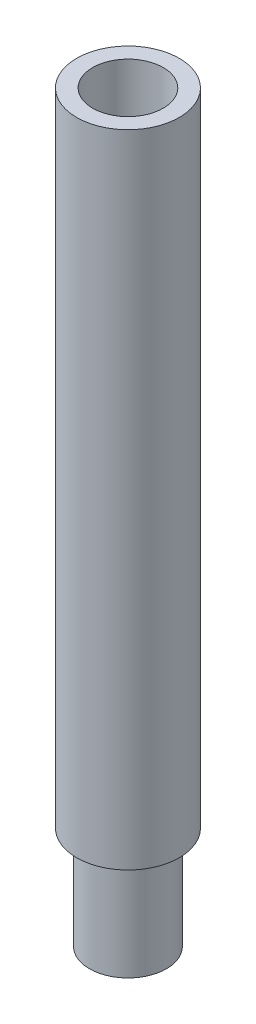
from build123d import *

# Parameters (mm, degrees)
F_5_16_24_TAPPED_HOLE1_D     = 6.9088
F_5_16_24_TAPPED_HOLE1_DEPTH = 21.336
F_5_16_24_TAPPED_HOLE1_TIP   = 2.075612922


with BuildPart() as part:
    # Sketch1 → Revolve1 (revolve)
    with BuildSketch(Plane.XY, mode=Mode.PRIVATE) as revolve1_sk:
        Polygon((0, 0), (9.525, 0), (9.525, 25.4), (12.7, 25.4), (12.7, 184.15), (8.73125, 184.15), (8.73125, 155.575), (0, 155.575), align=None)
    revolve(revolve1_sk.sketch.rotate(Axis((0, 0, 0), (0, -1, 0)), 90), axis=Axis((0, 0, 0), (0, -1, 0)))

    # 5_16-24 Tapped Hole1
    with Locations(Plane.XZ):
        with Locations((0, 0)):
            Hole(F_5_16_24_TAPPED_HOLE1_D / 2, depth=F_5_16_24_TAPPED_HOLE1_DEPTH)
            with Locations((0, 0, -(F_5_16_24_TAPPED_HOLE1_DEPTH + F_5_16_24_TAPPED_HOLE1_TIP / 2))):  # 118° drill point
                Cone(0, F_5_16_24_TAPPED_HOLE1_D / 2, F_5_16_24_TAPPED_HOLE1_TIP, mode=Mode.SUBTRACT)


solid = part.part
